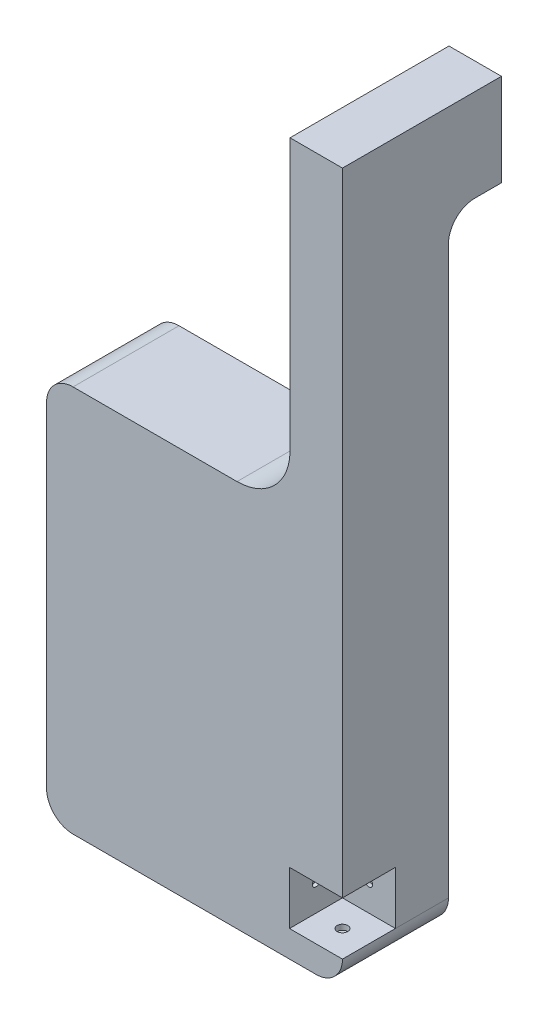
from build123d import *

# Parameters (mm, degrees)
BOSS_EXTRUDE1_DEPTH = 5.08
SKETCH2_W           = 2.514342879
SKETCH2_H           = 4.423428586
BOSS_EXTRUDE2_DEPTH = 2.54
FILLET1_R           = 1.27
SKETCH3_W           = 2.54
SKETCH3_H           = 2.54
CUT_EXTRUDE5_DEPTH  = 2.54
SKETCH7_R           = 0.254
CUT_EXTRUDE6_DEPTH  = 0.254
CUT_EXTRUDE7_START  = -0.254
SKETCH8_R           = 0.254
CUT_EXTRUDE7_DEPTH  = 0.254
SKETCH9_R           = 0.1778
CUT_EXTRUDE8_DEPTH  = 0.1778
SKETCH10_R          = 0.1778
CUT_EXTRUDE9_DEPTH  = 0.1778


with BuildPart() as part:
    # Sketch1 → Boss-Extrude1 (new body)
    with BuildSketch(Plane.XY):
        with BuildLine():
            Line((4.20382112, 20.558512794), (4.20382112, 23.475460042))
            Line((4.20382112, 23.475460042), (6.718163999, 23.475460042))
            Line((6.718163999, 23.475460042), (6.718163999, -9.362397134))
            ThreePointArc((6.718163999, -9.362397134), (6.346189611, -10.260422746), (5.448163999, -10.632397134))
            Line((5.448163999, -10.632397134), (-6.195748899, -10.632397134))
            ThreePointArc((-6.195748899, -10.632397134), (-7.093774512, -10.260422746), (-7.465748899, -9.362397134))
            Line((-7.465748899, -9.362397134), (-7.465748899, 6.663612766))
            ThreePointArc((-7.465748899, 6.663612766), (-7.093774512, 7.561638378), (-6.195748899, 7.933612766))
            Line((-6.195748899, 7.933612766), (1.66382112, 7.933612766))
            ThreePointArc((1.66382112, 7.933612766), (3.459872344, 8.677561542), (4.20382112, 10.473612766))
            Line((4.20382112, 10.473612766), (4.20382112, 20.558512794))
        make_face()
    extrude(amount=BOSS_EXTRUDE1_DEPTH)

    # Sketch2 → Boss-Extrude2 (add)
    with BuildSketch(Plane(origin=(0, 0, 0), x_dir=(-1, 0, 0), z_dir=(0, 0, -1))):
        with Locations((-5.46099256, 21.263745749)):
            Rectangle(SKETCH2_W, SKETCH2_H)
    extrude(amount=BOSS_EXTRUDE2_DEPTH)

    # Fillet1
    fillet1_edges = [part.edges().sort_by_distance(p)[0] for p in [
        (5.46099256, 19.052031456, 0),
    ]]
    fillet(fillet1_edges, radius=FILLET1_R)

    # Sketch3 → Cut-Extrude5 (cut)
    with BuildSketch(Plane.XY.offset(5.08)):
        with Locations((5.448163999, -8.092397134)):
            Rectangle(SKETCH3_W, SKETCH3_H)
    extrude(amount=-CUT_EXTRUDE5_DEPTH, mode=Mode.SUBTRACT)

    # Sketch7 → Cut-Extrude6 (cut)
    with BuildSketch(Plane.XZ.offset(6.822397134)):
        with Locations(Location((5.448163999, 3.81, 0), (0, 0, 270))):
            Circle(SKETCH7_R)
    extrude(amount=-CUT_EXTRUDE6_DEPTH, mode=Mode.SUBTRACT)

    # Sketch8 → Cut-Extrude7 (cut)
    with BuildSketch(Plane(origin=(0, -9.362397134, 0), x_dir=(1, 0, 0), z_dir=(0, 1, 0)).offset(CUT_EXTRUDE7_START)):
        with Locations(Location((5.448163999, -3.81, 0), (0, 0, 90))):
            Circle(SKETCH8_R)
    extrude(amount=CUT_EXTRUDE7_DEPTH, mode=Mode.SUBTRACT)

    # Sketch9 → Cut-Extrude8 (cut)
    with BuildSketch(Plane(origin=(4.178163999, 0, 0), x_dir=(0, 0, -1), z_dir=(1, 0, 0))):
        with Locations((-3.81, -8.092397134)):
            Circle(SKETCH9_R)
    extrude(amount=-CUT_EXTRUDE8_DEPTH, mode=Mode.SUBTRACT)

    # Sketch10 → Cut-Extrude9 (cut)
    with BuildSketch(Plane.XY.offset(2.54)):
        with Locations((5.448163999, -8.092397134)):
            Circle(SKETCH10_R)
    extrude(amount=-CUT_EXTRUDE9_DEPTH, mode=Mode.SUBTRACT)


solid = part.part
